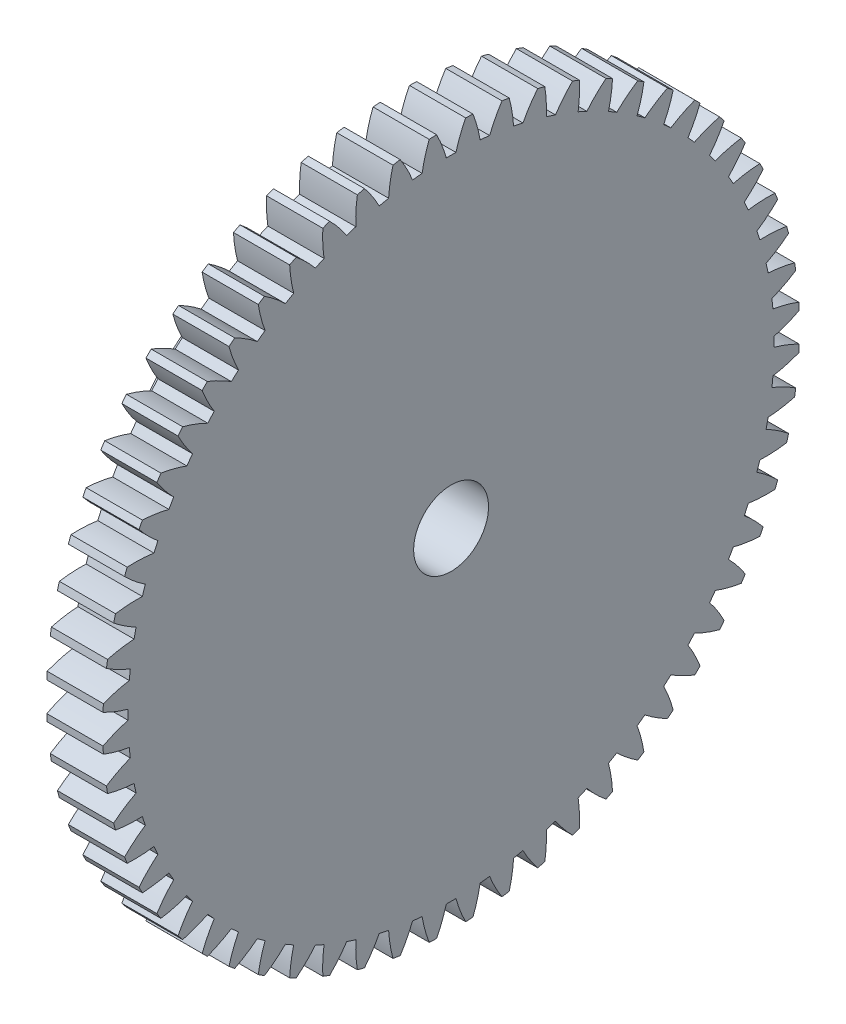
from build123d import *

# Parameters (mm, degrees)
BASPROSKE_W      = 15
BASPROSKE_H      = 93
TOOTHCUT_DEPTH   = 133.374468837
TEETHCUTS_COUNT  = 60
TEETHCUTS_ANGLE  = 354
HUBNEAONESKE_R   = 37.5
HUBNEARONE_DEPTH = 35.0003556
BORSKE_R         = 10
BORE_DEPTH       = 50.0003556


with BuildPart() as part:
    # BasProSke → Base-Revolve (revolve)
    with BuildSketch(Plane(origin=(0, 0, 0), x_dir=(1, 0, 0), z_dir=(0, 1, 0)), mode=Mode.PRIVATE) as base_revolve_sk:
        with Locations((7.5, 46.5)):
            Rectangle(BASPROSKE_W, BASPROSKE_H)
    revolve(base_revolve_sk.sketch.rotate(Axis((-10, 0, 0), (1, 0, 0)), 180), axis=Axis((-10, 0, 0), (1, 0, 0)))

    # TooCutSke → ToothCut (cut, through all)
    with BuildSketch(Plane(origin=(0, 0, 0), x_dir=(0, 0, -1), z_dir=(1, 0, 0))):
        with BuildLine():
            ThreePointArc((1.279271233, 86.239512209), (0, 86.249), (-1.279271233, 86.239512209))
            ThreePointArc((-1.279271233, 86.239512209), (-2.42160022, 89.657227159), (-3.899887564, 92.943616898))
            ThreePointArc((-3.899887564, 92.943616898), (0, 93.0254), (3.899887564, 92.943616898))
            ThreePointArc((3.899887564, 92.943616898), (2.42160022, 89.657227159), (1.279271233, 86.239512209))
        make_face()
    toothcut = extrude(amount=TOOTHCUT_DEPTH, mode=Mode.SUBTRACT)

    # TeethCuts: ToothCut ×60 about axis
    teethcuts_axis = Axis((-10, 0, 0), (1, 0, 0))
    for i in range(1, TEETHCUTS_COUNT):
        add(toothcut.rotate(teethcuts_axis, i * TEETHCUTS_ANGLE / (TEETHCUTS_COUNT - 1)), mode=Mode.SUBTRACT)

    # HubNeaOneSke → HubNearOne (add)
    with BuildSketch(Plane.ZY):
        with Locations(Location((0, 0, 0), (0, 0, 180))):
            Circle(HUBNEAONESKE_R)
    extrude(amount=HUBNEARONE_DEPTH)

    # BorSke → Bore (cut, symmetric)
    with BuildSketch(Plane(origin=(0, 0, 0), x_dir=(0, 0, -1), z_dir=(1, 0, 0))):
        with Locations(Location((0, 0, 0), (0, 0, 180))):
            Circle(BORSKE_R)
    extrude(amount=BORE_DEPTH, both=True, mode=Mode.SUBTRACT)


solid = part.part
